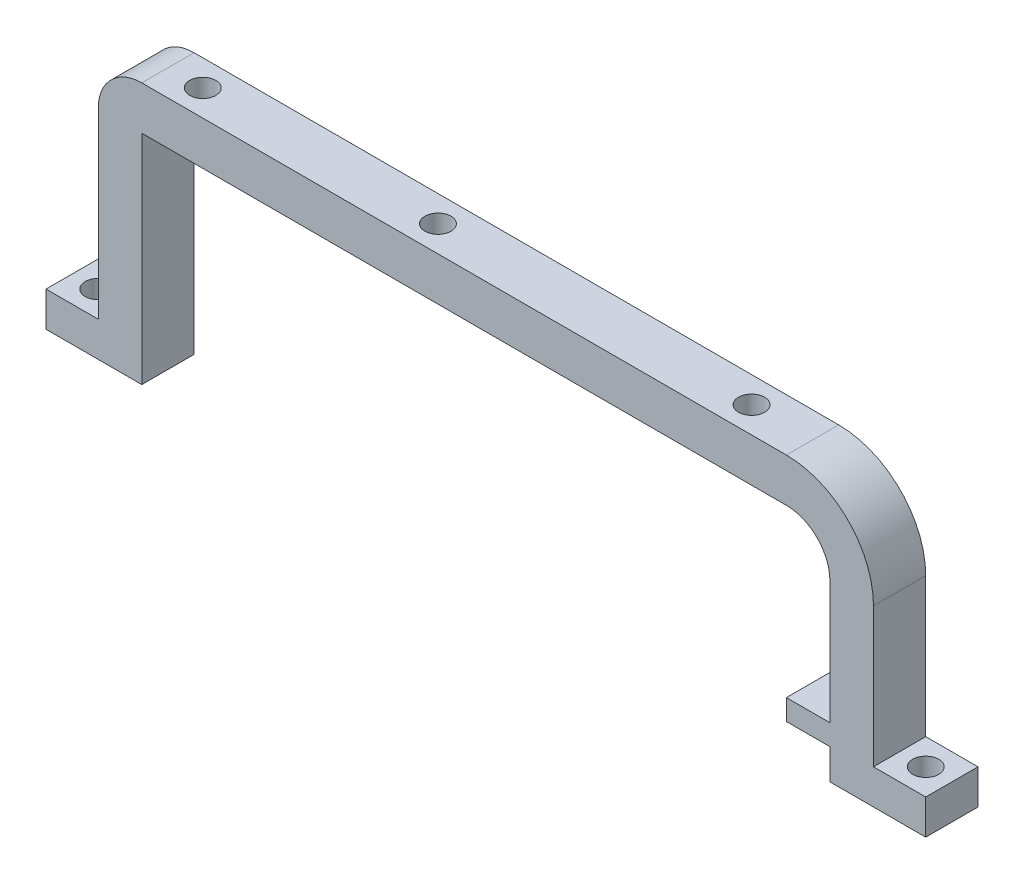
ISO-10303-21;
HEADER;
FILE_DESCRIPTION(('STEP AP214'),'2;1');
FILE_NAME('part.step','',(''),(''),'','','');
FILE_SCHEMA(('AUTOMOTIVE_DESIGN { 1 0 10303 214 1 1 1 1 }'));
ENDSEC;
DATA;
#1=APPLICATION_CONTEXT('core data for automotive mechanical design processes');
#2=APPLICATION_PROTOCOL_DEFINITION('international standard','automotive_design',2000,#1);
#3=PRODUCT_CONTEXT('',#1,'mechanical');
#4=PRODUCT('Part','Part','',(#3));
#5=PRODUCT_RELATED_PRODUCT_CATEGORY('part','',(#4));
#6=PRODUCT_DEFINITION_FORMATION('','',#4);
#7=PRODUCT_DEFINITION_CONTEXT('part definition',#1,'design');
#8=PRODUCT_DEFINITION('design','',#6,#7);
#9=PRODUCT_DEFINITION_SHAPE('','',#8);
#10=(LENGTH_UNIT() NAMED_UNIT(*) SI_UNIT(.MILLI.,.METRE.));
#11=(NAMED_UNIT(*) PLANE_ANGLE_UNIT() SI_UNIT($,.RADIAN.));
#12=(NAMED_UNIT(*) SI_UNIT($,.STERADIAN.) SOLID_ANGLE_UNIT());
#13=UNCERTAINTY_MEASURE_WITH_UNIT(LENGTH_MEASURE(1.E-05),#10,'distance_accuracy_value','');
#14=(GEOMETRIC_REPRESENTATION_CONTEXT(3) GLOBAL_UNCERTAINTY_ASSIGNED_CONTEXT((#13)) GLOBAL_UNIT_ASSIGNED_CONTEXT((#10,
#11,#12)) REPRESENTATION_CONTEXT('',''));
#15=CARTESIAN_POINT('',(0.,0.,0.));
#16=DIRECTION('',(0.,0.,1.));
#17=DIRECTION('',(1.,0.,0.));
#18=AXIS2_PLACEMENT_3D('',#15,#16,#17);
#19=CARTESIAN_POINT('',(-43.196397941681,-5.88336192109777,6.));
#20=DIRECTION('',(0.,1.,0.));
#21=DIRECTION('',(0.,0.,1.));
#22=AXIS2_PLACEMENT_3D('',#19,#20,#21);
#23=PLANE('',#22);
#24=CARTESIAN_POINT('',(-46.196397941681,-5.88336192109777,3.));
#25=DIRECTION('',(0.,1.,0.));
#26=DIRECTION('',(0.,0.,1.));
#27=AXIS2_PLACEMENT_3D('',#24,#25,#26);
#28=CIRCLE('',#27,1.5);
#29=CARTESIAN_POINT('',(-46.196397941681,-5.88336192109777,4.5));
#30=VERTEX_POINT('',#29);
#31=EDGE_CURVE('E451',#30,#30,#28,.T.);
#32=ORIENTED_EDGE('',*,*,#31,.T.);
#33=EDGE_LOOP('',(#32));
#34=FACE_BOUND('',#33,.T.);
#35=DIRECTION('',(1.,0.,0.));
#36=VECTOR('',#35,1.);
#37=CARTESIAN_POINT('',(-43.196397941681,-5.88336192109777,0.));
#38=LINE('',#37,#36);
#39=CARTESIAN_POINT('',(-49.1963979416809,-5.88336192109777,0.));
#40=VERTEX_POINT('',#39);
#41=CARTESIAN_POINT('',(-38.196397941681,-5.88336192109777,0.));
#42=VERTEX_POINT('',#41);
#43=EDGE_CURVE('E117',#40,#42,#38,.T.);
#44=ORIENTED_EDGE('',*,*,#43,.T.);
#45=DIRECTION('',(0.,0.,-1.));
#46=VECTOR('',#45,1.);
#47=CARTESIAN_POINT('',(-38.196397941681,-5.88336192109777,6.));
#48=LINE('',#47,#46);
#49=CARTESIAN_POINT('',(-38.196397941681,-5.88336192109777,6.));
#50=VERTEX_POINT('',#49);
#51=EDGE_CURVE('E11',#50,#42,#48,.T.);
#52=ORIENTED_EDGE('',*,*,#51,.F.);
#53=DIRECTION('',(1.,0.,0.));
#54=VECTOR('',#53,1.);
#55=CARTESIAN_POINT('',(-43.196397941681,-5.88336192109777,6.));
#56=LINE('',#55,#54);
#57=CARTESIAN_POINT('',(-49.1963979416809,-5.88336192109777,6.));
#58=VERTEX_POINT('',#57);
#59=EDGE_CURVE('E123',#58,#50,#56,.T.);
#60=ORIENTED_EDGE('',*,*,#59,.F.);
#61=DIRECTION('',(0.,0.,-1.));
#62=VECTOR('',#61,1.);
#63=CARTESIAN_POINT('',(-49.1963979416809,-5.88336192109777,6.));
#64=LINE('',#63,#62);
#65=EDGE_CURVE('E190',#58,#40,#64,.T.);
#66=ORIENTED_EDGE('',*,*,#65,.T.);
#67=EDGE_LOOP('',(#44,#52,#60,#66));
#68=FACE_BOUND('',#67,.T.);
#69=ADVANCED_FACE('F32',(#34,#68),#23,.F.);
#70=CARTESIAN_POINT('',(-38.196397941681,-5.88336192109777,6.));
#71=DIRECTION('',(-1.,0.,0.));
#72=DIRECTION('',(0.,0.,1.));
#73=AXIS2_PLACEMENT_3D('',#70,#71,#72);
#74=PLANE('',#73);
#75=DIRECTION('',(0.,1.,0.));
#76=VECTOR('',#75,1.);
#77=CARTESIAN_POINT('',(-38.196397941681,-5.88336192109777,0.));
#78=LINE('',#77,#76);
#79=CARTESIAN_POINT('',(-38.196397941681,19.1166380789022,0.));
#80=VERTEX_POINT('',#79);
#81=EDGE_CURVE('E195',#42,#80,#78,.T.);
#82=ORIENTED_EDGE('',*,*,#81,.T.);
#83=DIRECTION('',(0.,0.,-1.));
#84=VECTOR('',#83,1.);
#85=CARTESIAN_POINT('',(-38.196397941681,19.1166380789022,6.));
#86=LINE('',#85,#84);
#87=CARTESIAN_POINT('',(-38.196397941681,19.1166380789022,6.));
#88=VERTEX_POINT('',#87);
#89=EDGE_CURVE('E40',#88,#80,#86,.T.);
#90=ORIENTED_EDGE('',*,*,#89,.F.);
#91=DIRECTION('',(0.,1.,0.));
#92=VECTOR('',#91,1.);
#93=CARTESIAN_POINT('',(-38.196397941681,-5.88336192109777,6.));
#94=LINE('',#93,#92);
#95=EDGE_CURVE('E334',#50,#88,#94,.T.);
#96=ORIENTED_EDGE('',*,*,#95,.F.);
#97=ORIENTED_EDGE('',*,*,#51,.T.);
#98=EDGE_LOOP('',(#82,#90,#96,#97));
#99=FACE_BOUND('',#98,.T.);
#100=ADVANCED_FACE('F339',(#99),#74,.F.);
#101=CARTESIAN_POINT('',(-38.196397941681,19.1166380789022,6.));
#102=DIRECTION('',(0.,1.,0.));
#103=DIRECTION('',(0.,0.,1.));
#104=AXIS2_PLACEMENT_3D('',#101,#102,#103);
#105=PLANE('',#104);
#106=CARTESIAN_POINT('',(-7.19639794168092,19.1166380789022,3.));
#107=DIRECTION('',(0.,1.,0.));
#108=DIRECTION('',(0.,0.,1.));
#109=AXIS2_PLACEMENT_3D('',#106,#107,#108);
#110=CIRCLE('',#109,1.5);
#111=CARTESIAN_POINT('',(-7.19639794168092,19.1166380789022,4.5));
#112=VERTEX_POINT('',#111);
#113=EDGE_CURVE('E432',#112,#112,#110,.T.);
#114=ORIENTED_EDGE('',*,*,#113,.T.);
#115=EDGE_LOOP('',(#114));
#116=FACE_BOUND('',#115,.T.);
#117=CARTESIAN_POINT('',(-34.1963979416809,19.1166380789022,3.));
#118=DIRECTION('',(0.,1.,0.));
#119=DIRECTION('',(0.,0.,1.));
#120=AXIS2_PLACEMENT_3D('',#117,#118,#119);
#121=CIRCLE('',#120,1.5);
#122=CARTESIAN_POINT('',(-34.1963979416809,19.1166380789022,4.5));
#123=VERTEX_POINT('',#122);
#124=EDGE_CURVE('E436',#123,#123,#121,.T.);
#125=ORIENTED_EDGE('',*,*,#124,.T.);
#126=EDGE_LOOP('',(#125));
#127=FACE_BOUND('',#126,.T.);
#128=CARTESIAN_POINT('',(28.8036020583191,19.1166380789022,3.));
#129=DIRECTION('',(0.,1.,0.));
#130=DIRECTION('',(0.,0.,1.));
#131=AXIS2_PLACEMENT_3D('',#128,#129,#130);
#132=CIRCLE('',#131,1.5);
#133=CARTESIAN_POINT('',(28.8036020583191,19.1166380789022,4.5));
#134=VERTEX_POINT('',#133);
#135=EDGE_CURVE('E445',#134,#134,#132,.T.);
#136=ORIENTED_EDGE('',*,*,#135,.T.);
#137=EDGE_LOOP('',(#136));
#138=FACE_BOUND('',#137,.T.);
#139=DIRECTION('',(1.,0.,0.));
#140=VECTOR('',#139,1.);
#141=CARTESIAN_POINT('',(-38.196397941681,19.1166380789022,0.));
#142=LINE('',#141,#140);
#143=CARTESIAN_POINT('',(35.803602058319,19.1166380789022,0.));
#144=VERTEX_POINT('',#143);
#145=EDGE_CURVE('E198',#80,#144,#142,.T.);
#146=ORIENTED_EDGE('',*,*,#145,.T.);
#147=DIRECTION('',(0.,0.,-1.));
#148=VECTOR('',#147,1.);
#149=CARTESIAN_POINT('',(35.803602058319,19.1166380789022,6.));
#150=LINE('',#149,#148);
#151=CARTESIAN_POINT('',(35.803602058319,19.1166380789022,6.));
#152=VERTEX_POINT('',#151);
#153=EDGE_CURVE('E271',#152,#144,#150,.T.);
#154=ORIENTED_EDGE('',*,*,#153,.F.);
#155=DIRECTION('',(1.,0.,0.));
#156=VECTOR('',#155,1.);
#157=CARTESIAN_POINT('',(-38.196397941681,19.1166380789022,6.));
#158=LINE('',#157,#156);
#159=EDGE_CURVE('E280',#88,#152,#158,.T.);
#160=ORIENTED_EDGE('',*,*,#159,.F.);
#161=ORIENTED_EDGE('',*,*,#89,.T.);
#162=EDGE_LOOP('',(#146,#154,#160,#161));
#163=FACE_BOUND('',#162,.T.);
#164=ADVANCED_FACE('F278',(#116,#127,#138,#163),#105,.F.);
#165=CARTESIAN_POINT('',(35.8036020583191,14.1166380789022,6.));
#166=DIRECTION('',(0.,0.,-1.));
#167=DIRECTION('',(-1.,0.,0.));
#168=AXIS2_PLACEMENT_3D('',#165,#166,#167);
#169=CYLINDRICAL_SURFACE('',#168,5.);
#170=CARTESIAN_POINT('',(35.8036020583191,14.1166380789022,0.));
#171=DIRECTION('',(0.,0.,-1.));
#172=DIRECTION('',(-1.,0.,0.));
#173=AXIS2_PLACEMENT_3D('',#170,#171,#172);
#174=CIRCLE('',#173,5.);
#175=CARTESIAN_POINT('',(40.8036020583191,14.1166380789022,0.));
#176=VERTEX_POINT('',#175);
#177=EDGE_CURVE('E200',#144,#176,#174,.T.);
#178=ORIENTED_EDGE('',*,*,#177,.T.);
#179=DIRECTION('',(0.,0.,-1.));
#180=VECTOR('',#179,1.);
#181=CARTESIAN_POINT('',(40.8036020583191,14.1166380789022,6.));
#182=LINE('',#181,#180);
#183=CARTESIAN_POINT('',(40.8036020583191,14.1166380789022,6.));
#184=VERTEX_POINT('',#183);
#185=EDGE_CURVE('E268',#184,#176,#182,.T.);
#186=ORIENTED_EDGE('',*,*,#185,.F.);
#187=CARTESIAN_POINT('',(35.8036020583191,14.1166380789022,6.));
#188=DIRECTION('',(0.,0.,-1.));
#189=DIRECTION('',(-1.,0.,0.));
#190=AXIS2_PLACEMENT_3D('',#187,#188,#189);
#191=CIRCLE('',#190,5.);
#192=EDGE_CURVE('E298',#152,#184,#191,.T.);
#193=ORIENTED_EDGE('',*,*,#192,.F.);
#194=ORIENTED_EDGE('',*,*,#153,.T.);
#195=EDGE_LOOP('',(#178,#186,#193,#194));
#196=FACE_BOUND('',#195,.T.);
#197=ADVANCED_FACE('F289',(#196),#169,.F.);
#198=CARTESIAN_POINT('',(40.8036020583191,0.,6.));
#199=DIRECTION('',(1.,0.,0.));
#200=DIRECTION('',(0.,0.,-1.));
#201=AXIS2_PLACEMENT_3D('',#198,#199,#200);
#202=PLANE('',#201);
#203=DIRECTION('',(0.,-1.,0.));
#204=VECTOR('',#203,1.);
#205=CARTESIAN_POINT('',(40.8036020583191,0.,0.));
#206=LINE('',#205,#204);
#207=CARTESIAN_POINT('',(40.8036020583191,0.,0.));
#208=VERTEX_POINT('',#207);
#209=EDGE_CURVE('E202',#176,#208,#206,.T.);
#210=ORIENTED_EDGE('',*,*,#209,.T.);
#211=DIRECTION('',(0.,0.,-1.));
#212=VECTOR('',#211,1.);
#213=CARTESIAN_POINT('',(40.8036020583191,0.,6.));
#214=LINE('',#213,#212);
#215=CARTESIAN_POINT('',(40.8036020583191,0.,6.));
#216=VERTEX_POINT('',#215);
#217=EDGE_CURVE('E265',#216,#208,#214,.T.);
#218=ORIENTED_EDGE('',*,*,#217,.F.);
#219=DIRECTION('',(0.,-1.,0.));
#220=VECTOR('',#219,1.);
#221=CARTESIAN_POINT('',(40.8036020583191,0.,6.));
#222=LINE('',#221,#220);
#223=EDGE_CURVE('E295',#184,#216,#222,.T.);
#224=ORIENTED_EDGE('',*,*,#223,.F.);
#225=ORIENTED_EDGE('',*,*,#185,.T.);
#226=EDGE_LOOP('',(#210,#218,#224,#225));
#227=FACE_BOUND('',#226,.T.);
#228=ADVANCED_FACE('F293',(#227),#202,.F.);
#229=CARTESIAN_POINT('',(35.8036020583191,0.,6.));
#230=DIRECTION('',(0.,-1.,0.));
#231=DIRECTION('',(0.,0.,-1.));
#232=AXIS2_PLACEMENT_3D('',#229,#230,#231);
#233=PLANE('',#232);
#234=DIRECTION('',(-1.,0.,0.));
#235=VECTOR('',#234,1.);
#236=CARTESIAN_POINT('',(35.8036020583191,0.,0.));
#237=LINE('',#236,#235);
#238=CARTESIAN_POINT('',(35.8036020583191,0.,0.));
#239=VERTEX_POINT('',#238);
#240=EDGE_CURVE('E204',#208,#239,#237,.T.);
#241=ORIENTED_EDGE('',*,*,#240,.T.);
#242=DIRECTION('',(0.,0.,-1.));
#243=VECTOR('',#242,1.);
#244=CARTESIAN_POINT('',(35.8036020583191,0.,6.));
#245=LINE('',#244,#243);
#246=CARTESIAN_POINT('',(35.8036020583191,0.,6.));
#247=VERTEX_POINT('',#246);
#248=EDGE_CURVE('E262',#247,#239,#245,.T.);
#249=ORIENTED_EDGE('',*,*,#248,.F.);
#250=DIRECTION('',(-1.,0.,0.));
#251=VECTOR('',#250,1.);
#252=CARTESIAN_POINT('',(35.8036020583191,0.,6.));
#253=LINE('',#252,#251);
#254=EDGE_CURVE('E297',#216,#247,#253,.T.);
#255=ORIENTED_EDGE('',*,*,#254,.F.);
#256=ORIENTED_EDGE('',*,*,#217,.T.);
#257=EDGE_LOOP('',(#241,#249,#255,#256));
#258=FACE_BOUND('',#257,.T.);
#259=ADVANCED_FACE('F353',(#258),#233,.F.);
#260=CARTESIAN_POINT('',(35.8036020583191,-2.38336192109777,6.));
#261=DIRECTION('',(1.,0.,0.));
#262=DIRECTION('',(0.,0.,-1.));
#263=AXIS2_PLACEMENT_3D('',#260,#261,#262);
#264=PLANE('',#263);
#265=DIRECTION('',(0.,-1.,0.));
#266=VECTOR('',#265,1.);
#267=CARTESIAN_POINT('',(35.8036020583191,-2.38336192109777,0.));
#268=LINE('',#267,#266);
#269=CARTESIAN_POINT('',(35.8036020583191,-2.38336192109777,0.));
#270=VERTEX_POINT('',#269);
#271=EDGE_CURVE('E206',#239,#270,#268,.T.);
#272=ORIENTED_EDGE('',*,*,#271,.T.);
#273=DIRECTION('',(0.,0.,-1.));
#274=VECTOR('',#273,1.);
#275=CARTESIAN_POINT('',(35.8036020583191,-2.38336192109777,6.));
#276=LINE('',#275,#274);
#277=CARTESIAN_POINT('',(35.8036020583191,-2.38336192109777,6.));
#278=VERTEX_POINT('',#277);
#279=EDGE_CURVE('E259',#278,#270,#276,.T.);
#280=ORIENTED_EDGE('',*,*,#279,.F.);
#281=DIRECTION('',(0.,-1.,0.));
#282=VECTOR('',#281,1.);
#283=CARTESIAN_POINT('',(35.8036020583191,-2.38336192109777,6.));
#284=LINE('',#283,#282);
#285=EDGE_CURVE('E300',#247,#278,#284,.T.);
#286=ORIENTED_EDGE('',*,*,#285,.F.);
#287=ORIENTED_EDGE('',*,*,#248,.T.);
#288=EDGE_LOOP('',(#272,#280,#286,#287));
#289=FACE_BOUND('',#288,.T.);
#290=ADVANCED_FACE('F356',(#289),#264,.F.);
#291=CARTESIAN_POINT('',(35.8036020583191,-2.38336192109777,6.));
#292=DIRECTION('',(0.,1.,0.));
#293=DIRECTION('',(0.,0.,1.));
#294=AXIS2_PLACEMENT_3D('',#291,#292,#293);
#295=PLANE('',#294);
#296=DIRECTION('',(1.,0.,0.));
#297=VECTOR('',#296,1.);
#298=CARTESIAN_POINT('',(35.8036020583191,-2.38336192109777,0.));
#299=LINE('',#298,#297);
#300=CARTESIAN_POINT('',(40.8036020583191,-2.38336192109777,0.));
#301=VERTEX_POINT('',#300);
#302=EDGE_CURVE('E208',#270,#301,#299,.T.);
#303=ORIENTED_EDGE('',*,*,#302,.T.);
#304=DIRECTION('',(0.,0.,-1.));
#305=VECTOR('',#304,1.);
#306=CARTESIAN_POINT('',(40.8036020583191,-2.38336192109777,6.));
#307=LINE('',#306,#305);
#308=CARTESIAN_POINT('',(40.8036020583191,-2.38336192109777,6.));
#309=VERTEX_POINT('',#308);
#310=EDGE_CURVE('E256',#309,#301,#307,.T.);
#311=ORIENTED_EDGE('',*,*,#310,.F.);
#312=DIRECTION('',(1.,0.,0.));
#313=VECTOR('',#312,1.);
#314=CARTESIAN_POINT('',(35.8036020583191,-2.38336192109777,6.));
#315=LINE('',#314,#313);
#316=EDGE_CURVE('E306',#278,#309,#315,.T.);
#317=ORIENTED_EDGE('',*,*,#316,.F.);
#318=ORIENTED_EDGE('',*,*,#279,.T.);
#319=EDGE_LOOP('',(#303,#311,#317,#318));
#320=FACE_BOUND('',#319,.T.);
#321=ADVANCED_FACE('F360',(#320),#295,.F.);
#322=CARTESIAN_POINT('',(40.8036020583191,-5.88336192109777,6.));
#323=DIRECTION('',(1.,0.,0.));
#324=DIRECTION('',(0.,0.,-1.));
#325=AXIS2_PLACEMENT_3D('',#322,#323,#324);
#326=PLANE('',#325);
#327=DIRECTION('',(0.,-1.,0.));
#328=VECTOR('',#327,1.);
#329=CARTESIAN_POINT('',(40.8036020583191,-5.88336192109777,0.));
#330=LINE('',#329,#328);
#331=CARTESIAN_POINT('',(40.8036020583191,-5.88336192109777,0.));
#332=VERTEX_POINT('',#331);
#333=EDGE_CURVE('E210',#301,#332,#330,.T.);
#334=ORIENTED_EDGE('',*,*,#333,.T.);
#335=DIRECTION('',(0.,0.,-1.));
#336=VECTOR('',#335,1.);
#337=CARTESIAN_POINT('',(40.8036020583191,-5.88336192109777,6.));
#338=LINE('',#337,#336);
#339=CARTESIAN_POINT('',(40.8036020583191,-5.88336192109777,6.));
#340=VERTEX_POINT('',#339);
#341=EDGE_CURVE('E253',#340,#332,#338,.T.);
#342=ORIENTED_EDGE('',*,*,#341,.F.);
#343=DIRECTION('',(0.,-1.,0.));
#344=VECTOR('',#343,1.);
#345=CARTESIAN_POINT('',(40.8036020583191,-5.88336192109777,6.));
#346=LINE('',#345,#344);
#347=EDGE_CURVE('E308',#309,#340,#346,.T.);
#348=ORIENTED_EDGE('',*,*,#347,.F.);
#349=ORIENTED_EDGE('',*,*,#310,.T.);
#350=EDGE_LOOP('',(#334,#342,#348,#349));
#351=FACE_BOUND('',#350,.T.);
#352=ADVANCED_FACE('F364',(#351),#326,.F.);
#353=CARTESIAN_POINT('',(51.8036020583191,-5.88336192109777,6.));
#354=DIRECTION('',(0.,1.,0.));
#355=DIRECTION('',(0.,0.,1.));
#356=AXIS2_PLACEMENT_3D('',#353,#354,#355);
#357=PLANE('',#356);
#358=CARTESIAN_POINT('',(48.8036020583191,-5.88336192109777,3.));
#359=DIRECTION('',(0.,1.,0.));
#360=DIRECTION('',(0.,0.,1.));
#361=AXIS2_PLACEMENT_3D('',#358,#359,#360);
#362=CIRCLE('',#361,1.5);
#363=CARTESIAN_POINT('',(48.8036020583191,-5.88336192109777,4.5));
#364=VERTEX_POINT('',#363);
#365=EDGE_CURVE('E196',#364,#364,#362,.T.);
#366=ORIENTED_EDGE('',*,*,#365,.T.);
#367=EDGE_LOOP('',(#366));
#368=FACE_BOUND('',#367,.T.);
#369=DIRECTION('',(1.,0.,0.));
#370=VECTOR('',#369,1.);
#371=CARTESIAN_POINT('',(51.8036020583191,-5.88336192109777,0.));
#372=LINE('',#371,#370);
#373=CARTESIAN_POINT('',(51.8036020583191,-5.88336192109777,0.));
#374=VERTEX_POINT('',#373);
#375=EDGE_CURVE('E213',#332,#374,#372,.T.);
#376=ORIENTED_EDGE('',*,*,#375,.T.);
#377=DIRECTION('',(0.,0.,-1.));
#378=VECTOR('',#377,1.);
#379=CARTESIAN_POINT('',(51.8036020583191,-5.88336192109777,6.));
#380=LINE('',#379,#378);
#381=CARTESIAN_POINT('',(51.8036020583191,-5.88336192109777,6.));
#382=VERTEX_POINT('',#381);
#383=EDGE_CURVE('E250',#382,#374,#380,.T.);
#384=ORIENTED_EDGE('',*,*,#383,.F.);
#385=DIRECTION('',(1.,0.,0.));
#386=VECTOR('',#385,1.);
#387=CARTESIAN_POINT('',(40.8036020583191,-5.88336192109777,6.));
#388=LINE('',#387,#386);
#389=EDGE_CURVE('E310',#340,#382,#388,.T.);
#390=ORIENTED_EDGE('',*,*,#389,.F.);
#391=ORIENTED_EDGE('',*,*,#341,.T.);
#392=EDGE_LOOP('',(#376,#384,#390,#391));
#393=FACE_BOUND('',#392,.T.);
#394=ADVANCED_FACE('F368',(#368,#393),#357,.F.);
#395=CARTESIAN_POINT('',(51.8036020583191,-5.88336192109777,6.));
#396=DIRECTION('',(-1.,0.,0.));
#397=DIRECTION('',(0.,0.,1.));
#398=AXIS2_PLACEMENT_3D('',#395,#396,#397);
#399=PLANE('',#398);
#400=DIRECTION('',(0.,1.,0.));
#401=VECTOR('',#400,1.);
#402=CARTESIAN_POINT('',(51.8036020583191,-5.88336192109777,0.));
#403=LINE('',#402,#401);
#404=CARTESIAN_POINT('',(51.8036020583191,-1.88336192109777,0.));
#405=VERTEX_POINT('',#404);
#406=EDGE_CURVE('E215',#374,#405,#403,.T.);
#407=ORIENTED_EDGE('',*,*,#406,.T.);
#408=DIRECTION('',(0.,0.,-1.));
#409=VECTOR('',#408,1.);
#410=CARTESIAN_POINT('',(51.8036020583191,-1.88336192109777,6.));
#411=LINE('',#410,#409);
#412=CARTESIAN_POINT('',(51.8036020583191,-1.88336192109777,6.));
#413=VERTEX_POINT('',#412);
#414=EDGE_CURVE('E247',#413,#405,#411,.T.);
#415=ORIENTED_EDGE('',*,*,#414,.F.);
#416=DIRECTION('',(0.,1.,0.));
#417=VECTOR('',#416,1.);
#418=CARTESIAN_POINT('',(51.8036020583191,-5.88336192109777,6.));
#419=LINE('',#418,#417);
#420=EDGE_CURVE('E312',#382,#413,#419,.T.);
#421=ORIENTED_EDGE('',*,*,#420,.F.);
#422=ORIENTED_EDGE('',*,*,#383,.T.);
#423=EDGE_LOOP('',(#407,#415,#421,#422));
#424=FACE_BOUND('',#423,.T.);
#425=ADVANCED_FACE('F372',(#424),#399,.F.);
#426=CARTESIAN_POINT('',(51.8036020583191,-1.88336192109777,6.));
#427=DIRECTION('',(0.,-1.,0.));
#428=DIRECTION('',(0.,0.,-1.));
#429=AXIS2_PLACEMENT_3D('',#426,#427,#428);
#430=PLANE('',#429);
#431=CARTESIAN_POINT('',(48.8036020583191,-1.88336192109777,3.));
#432=DIRECTION('',(0.,1.,0.));
#433=DIRECTION('',(0.,0.,1.));
#434=AXIS2_PLACEMENT_3D('',#431,#432,#433);
#435=CIRCLE('',#434,1.5);
#436=CARTESIAN_POINT('',(48.8036020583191,-1.88336192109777,4.5));
#437=VERTEX_POINT('',#436);
#438=EDGE_CURVE('E453',#437,#437,#435,.T.);
#439=ORIENTED_EDGE('',*,*,#438,.F.);
#440=EDGE_LOOP('',(#439));
#441=FACE_BOUND('',#440,.T.);
#442=DIRECTION('',(-1.,0.,0.));
#443=VECTOR('',#442,1.);
#444=CARTESIAN_POINT('',(51.8036020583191,-1.88336192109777,0.));
#445=LINE('',#444,#443);
#446=CARTESIAN_POINT('',(45.8036020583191,-1.88336192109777,0.));
#447=VERTEX_POINT('',#446);
#448=EDGE_CURVE('E217',#405,#447,#445,.T.);
#449=ORIENTED_EDGE('',*,*,#448,.T.);
#450=DIRECTION('',(0.,0.,-1.));
#451=VECTOR('',#450,1.);
#452=CARTESIAN_POINT('',(45.8036020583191,-1.88336192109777,6.));
#453=LINE('',#452,#451);
#454=CARTESIAN_POINT('',(45.8036020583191,-1.88336192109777,6.));
#455=VERTEX_POINT('',#454);
#456=EDGE_CURVE('E244',#455,#447,#453,.T.);
#457=ORIENTED_EDGE('',*,*,#456,.F.);
#458=DIRECTION('',(-1.,0.,0.));
#459=VECTOR('',#458,1.);
#460=CARTESIAN_POINT('',(51.8036020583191,-1.88336192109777,6.));
#461=LINE('',#460,#459);
#462=EDGE_CURVE('E314',#413,#455,#461,.T.);
#463=ORIENTED_EDGE('',*,*,#462,.F.);
#464=ORIENTED_EDGE('',*,*,#414,.T.);
#465=EDGE_LOOP('',(#449,#457,#463,#464));
#466=FACE_BOUND('',#465,.T.);
#467=ADVANCED_FACE('F376',(#441,#466),#430,.F.);
#468=CARTESIAN_POINT('',(45.8036020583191,-1.88336192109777,6.));
#469=DIRECTION('',(-1.,0.,0.));
#470=DIRECTION('',(0.,-1.,0.));
#471=AXIS2_PLACEMENT_3D('',#468,#469,#470);
#472=PLANE('',#471);
#473=DIRECTION('',(0.,1.,0.));
#474=VECTOR('',#473,1.);
#475=CARTESIAN_POINT('',(45.8036020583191,-1.88336192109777,0.));
#476=LINE('',#475,#474);
#477=CARTESIAN_POINT('',(45.8036020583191,14.1166380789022,0.));
#478=VERTEX_POINT('',#477);
#479=EDGE_CURVE('E219',#447,#478,#476,.T.);
#480=ORIENTED_EDGE('',*,*,#479,.T.);
#481=DIRECTION('',(0.,0.,-1.));
#482=VECTOR('',#481,1.);
#483=CARTESIAN_POINT('',(45.8036020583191,14.1166380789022,6.));
#484=LINE('',#483,#482);
#485=CARTESIAN_POINT('',(45.8036020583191,14.1166380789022,6.));
#486=VERTEX_POINT('',#485);
#487=EDGE_CURVE('E241',#486,#478,#484,.T.);
#488=ORIENTED_EDGE('',*,*,#487,.F.);
#489=DIRECTION('',(0.,1.,0.));
#490=VECTOR('',#489,1.);
#491=CARTESIAN_POINT('',(45.8036020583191,-1.88336192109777,6.));
#492=LINE('',#491,#490);
#493=EDGE_CURVE('E316',#455,#486,#492,.T.);
#494=ORIENTED_EDGE('',*,*,#493,.F.);
#495=ORIENTED_EDGE('',*,*,#456,.T.);
#496=EDGE_LOOP('',(#480,#488,#494,#495));
#497=FACE_BOUND('',#496,.T.);
#498=ADVANCED_FACE('F380',(#497),#472,.F.);
#499=CARTESIAN_POINT('',(35.8036020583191,14.1166380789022,6.));
#500=DIRECTION('',(0.,0.,-1.));
#501=DIRECTION('',(-1.,0.,0.));
#502=AXIS2_PLACEMENT_3D('',#499,#500,#501);
#503=CYLINDRICAL_SURFACE('',#502,10.);
#504=CARTESIAN_POINT('',(35.8036020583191,14.1166380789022,0.));
#505=DIRECTION('',(0.,0.,1.));
#506=DIRECTION('',(-1.,0.,0.));
#507=AXIS2_PLACEMENT_3D('',#504,#505,#506);
#508=CIRCLE('',#507,10.);
#509=CARTESIAN_POINT('',(35.803602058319,24.1166380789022,0.));
#510=VERTEX_POINT('',#509);
#511=EDGE_CURVE('E221',#478,#510,#508,.T.);
#512=ORIENTED_EDGE('',*,*,#511,.T.);
#513=DIRECTION('',(0.,0.,-1.));
#514=VECTOR('',#513,1.);
#515=CARTESIAN_POINT('',(35.803602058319,24.1166380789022,6.));
#516=LINE('',#515,#514);
#517=CARTESIAN_POINT('',(35.803602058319,24.1166380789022,6.));
#518=VERTEX_POINT('',#517);
#519=EDGE_CURVE('E238',#518,#510,#516,.T.);
#520=ORIENTED_EDGE('',*,*,#519,.F.);
#521=CARTESIAN_POINT('',(35.8036020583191,14.1166380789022,6.));
#522=DIRECTION('',(0.,0.,1.));
#523=DIRECTION('',(-1.,0.,0.));
#524=AXIS2_PLACEMENT_3D('',#521,#522,#523);
#525=CIRCLE('',#524,10.);
#526=EDGE_CURVE('E318',#486,#518,#525,.T.);
#527=ORIENTED_EDGE('',*,*,#526,.F.);
#528=ORIENTED_EDGE('',*,*,#487,.T.);
#529=EDGE_LOOP('',(#512,#520,#527,#528));
#530=FACE_BOUND('',#529,.T.);
#531=ADVANCED_FACE('F384',(#530),#503,.T.);
#532=CARTESIAN_POINT('',(-38.1963979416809,24.1166380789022,6.));
#533=DIRECTION('',(0.,-1.,0.));
#534=DIRECTION('',(0.,0.,-1.));
#535=AXIS2_PLACEMENT_3D('',#532,#533,#534);
#536=PLANE('',#535);
#537=CARTESIAN_POINT('',(-7.19639794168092,24.1166380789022,3.));
#538=DIRECTION('',(0.,1.,0.));
#539=DIRECTION('',(0.,0.,1.));
#540=AXIS2_PLACEMENT_3D('',#537,#538,#539);
#541=CIRCLE('',#540,1.5);
#542=CARTESIAN_POINT('',(-7.19639794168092,24.1166380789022,4.5));
#543=VERTEX_POINT('',#542);
#544=EDGE_CURVE('E429',#543,#543,#541,.T.);
#545=ORIENTED_EDGE('',*,*,#544,.F.);
#546=EDGE_LOOP('',(#545));
#547=FACE_BOUND('',#546,.T.);
#548=CARTESIAN_POINT('',(-34.1963979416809,24.1166380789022,3.));
#549=DIRECTION('',(0.,1.,0.));
#550=DIRECTION('',(0.,0.,1.));
#551=AXIS2_PLACEMENT_3D('',#548,#549,#550);
#552=CIRCLE('',#551,1.5);
#553=CARTESIAN_POINT('',(-34.1963979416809,24.1166380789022,4.5));
#554=VERTEX_POINT('',#553);
#555=EDGE_CURVE('E433',#554,#554,#552,.T.);
#556=ORIENTED_EDGE('',*,*,#555,.F.);
#557=EDGE_LOOP('',(#556));
#558=FACE_BOUND('',#557,.T.);
#559=CARTESIAN_POINT('',(28.8036020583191,24.1166380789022,3.));
#560=DIRECTION('',(0.,1.,0.));
#561=DIRECTION('',(0.,0.,1.));
#562=AXIS2_PLACEMENT_3D('',#559,#560,#561);
#563=CIRCLE('',#562,1.5);
#564=CARTESIAN_POINT('',(28.8036020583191,24.1166380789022,4.5));
#565=VERTEX_POINT('',#564);
#566=EDGE_CURVE('E442',#565,#565,#563,.T.);
#567=ORIENTED_EDGE('',*,*,#566,.F.);
#568=EDGE_LOOP('',(#567));
#569=FACE_BOUND('',#568,.T.);
#570=DIRECTION('',(-1.,0.,0.));
#571=VECTOR('',#570,1.);
#572=CARTESIAN_POINT('',(-38.1963979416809,24.1166380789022,0.));
#573=LINE('',#572,#571);
#574=CARTESIAN_POINT('',(-38.1963979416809,24.1166380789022,0.));
#575=VERTEX_POINT('',#574);
#576=EDGE_CURVE('E223',#510,#575,#573,.T.);
#577=ORIENTED_EDGE('',*,*,#576,.T.);
#578=DIRECTION('',(0.,0.,-1.));
#579=VECTOR('',#578,1.);
#580=CARTESIAN_POINT('',(-38.1963979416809,24.1166380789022,6.));
#581=LINE('',#580,#579);
#582=CARTESIAN_POINT('',(-38.1963979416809,24.1166380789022,6.));
#583=VERTEX_POINT('',#582);
#584=EDGE_CURVE('E235',#583,#575,#581,.T.);
#585=ORIENTED_EDGE('',*,*,#584,.F.);
#586=DIRECTION('',(-1.,0.,0.));
#587=VECTOR('',#586,1.);
#588=CARTESIAN_POINT('',(-38.1963979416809,24.1166380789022,6.));
#589=LINE('',#588,#587);
#590=EDGE_CURVE('E320',#518,#583,#589,.T.);
#591=ORIENTED_EDGE('',*,*,#590,.F.);
#592=ORIENTED_EDGE('',*,*,#519,.T.);
#593=EDGE_LOOP('',(#577,#585,#591,#592));
#594=FACE_BOUND('',#593,.T.);
#595=ADVANCED_FACE('F326',(#547,#558,#569,#594),#536,.F.);
#596=CARTESIAN_POINT('',(-38.196397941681,19.1166380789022,6.));
#597=DIRECTION('',(0.,0.,-1.));
#598=DIRECTION('',(-1.,0.,0.));
#599=AXIS2_PLACEMENT_3D('',#596,#597,#598);
#600=CYLINDRICAL_SURFACE('',#599,5.);
#601=CARTESIAN_POINT('',(-38.196397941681,19.1166380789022,0.));
#602=DIRECTION('',(0.,0.,1.));
#603=DIRECTION('',(1.,0.,0.));
#604=AXIS2_PLACEMENT_3D('',#601,#602,#603);
#605=CIRCLE('',#604,5.);
#606=CARTESIAN_POINT('',(-43.196397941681,19.1166380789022,0.));
#607=VERTEX_POINT('',#606);
#608=EDGE_CURVE('E225',#575,#607,#605,.T.);
#609=ORIENTED_EDGE('',*,*,#608,.T.);
#610=DIRECTION('',(0.,0.,-1.));
#611=VECTOR('',#610,1.);
#612=CARTESIAN_POINT('',(-43.196397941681,19.1166380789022,6.));
#613=LINE('',#612,#611);
#614=CARTESIAN_POINT('',(-43.196397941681,19.1166380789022,6.));
#615=VERTEX_POINT('',#614);
#616=EDGE_CURVE('E185',#615,#607,#613,.T.);
#617=ORIENTED_EDGE('',*,*,#616,.F.);
#618=CARTESIAN_POINT('',(-38.196397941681,19.1166380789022,6.));
#619=DIRECTION('',(0.,0.,1.));
#620=DIRECTION('',(1.,0.,0.));
#621=AXIS2_PLACEMENT_3D('',#618,#619,#620);
#622=CIRCLE('',#621,5.);
#623=EDGE_CURVE('E176',#583,#615,#622,.T.);
#624=ORIENTED_EDGE('',*,*,#623,.F.);
#625=ORIENTED_EDGE('',*,*,#584,.T.);
#626=EDGE_LOOP('',(#609,#617,#624,#625));
#627=FACE_BOUND('',#626,.T.);
#628=ADVANCED_FACE('F330',(#627),#600,.T.);
#629=CARTESIAN_POINT('',(-43.196397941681,-1.88336192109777,6.));
#630=DIRECTION('',(1.,0.,0.));
#631=DIRECTION('',(0.,0.,-1.));
#632=AXIS2_PLACEMENT_3D('',#629,#630,#631);
#633=PLANE('',#632);
#634=DIRECTION('',(0.,-1.,0.));
#635=VECTOR('',#634,1.);
#636=CARTESIAN_POINT('',(-43.196397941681,-1.88336192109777,0.));
#637=LINE('',#636,#635);
#638=CARTESIAN_POINT('',(-43.196397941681,-1.88336192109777,0.));
#639=VERTEX_POINT('',#638);
#640=EDGE_CURVE('E184',#607,#639,#637,.T.);
#641=ORIENTED_EDGE('',*,*,#640,.T.);
#642=DIRECTION('',(0.,0.,-1.));
#643=VECTOR('',#642,1.);
#644=CARTESIAN_POINT('',(-43.196397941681,-1.88336192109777,6.));
#645=LINE('',#644,#643);
#646=CARTESIAN_POINT('',(-43.196397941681,-1.88336192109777,6.));
#647=VERTEX_POINT('',#646);
#648=EDGE_CURVE('E181',#647,#639,#645,.T.);
#649=ORIENTED_EDGE('',*,*,#648,.F.);
#650=DIRECTION('',(0.,-1.,0.));
#651=VECTOR('',#650,1.);
#652=CARTESIAN_POINT('',(-43.196397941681,-1.88336192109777,6.));
#653=LINE('',#652,#651);
#654=EDGE_CURVE('E170',#615,#647,#653,.T.);
#655=ORIENTED_EDGE('',*,*,#654,.F.);
#656=ORIENTED_EDGE('',*,*,#616,.T.);
#657=EDGE_LOOP('',(#641,#649,#655,#656));
#658=FACE_BOUND('',#657,.T.);
#659=ADVANCED_FACE('F182',(#658),#633,.F.);
#660=CARTESIAN_POINT('',(-43.196397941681,-1.88336192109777,6.));
#661=DIRECTION('',(0.,-1.,0.));
#662=DIRECTION('',(0.,0.,-1.));
#663=AXIS2_PLACEMENT_3D('',#660,#661,#662);
#664=PLANE('',#663);
#665=CARTESIAN_POINT('',(-46.196397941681,-1.88336192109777,3.));
#666=DIRECTION('',(0.,1.,0.));
#667=DIRECTION('',(0.,0.,1.));
#668=AXIS2_PLACEMENT_3D('',#665,#666,#667);
#669=CIRCLE('',#668,1.5);
#670=CARTESIAN_POINT('',(-46.196397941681,-1.88336192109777,4.5));
#671=VERTEX_POINT('',#670);
#672=EDGE_CURVE('E448',#671,#671,#669,.T.);
#673=ORIENTED_EDGE('',*,*,#672,.F.);
#674=EDGE_LOOP('',(#673));
#675=FACE_BOUND('',#674,.T.);
#676=DIRECTION('',(-1.,0.,0.));
#677=VECTOR('',#676,1.);
#678=CARTESIAN_POINT('',(-43.196397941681,-1.88336192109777,0.));
#679=LINE('',#678,#677);
#680=CARTESIAN_POINT('',(-49.1963979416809,-1.88336192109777,0.));
#681=VERTEX_POINT('',#680);
#682=EDGE_CURVE('E110',#639,#681,#679,.T.);
#683=ORIENTED_EDGE('',*,*,#682,.T.);
#684=DIRECTION('',(0.,0.,-1.));
#685=VECTOR('',#684,1.);
#686=CARTESIAN_POINT('',(-49.1963979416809,-1.88336192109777,6.));
#687=LINE('',#686,#685);
#688=CARTESIAN_POINT('',(-49.1963979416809,-1.88336192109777,6.));
#689=VERTEX_POINT('',#688);
#690=EDGE_CURVE('E186',#689,#681,#687,.T.);
#691=ORIENTED_EDGE('',*,*,#690,.F.);
#692=DIRECTION('',(-1.,0.,0.));
#693=VECTOR('',#692,1.);
#694=CARTESIAN_POINT('',(-43.196397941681,-1.88336192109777,6.));
#695=LINE('',#694,#693);
#696=EDGE_CURVE('E174',#647,#689,#695,.T.);
#697=ORIENTED_EDGE('',*,*,#696,.F.);
#698=ORIENTED_EDGE('',*,*,#648,.T.);
#699=EDGE_LOOP('',(#683,#691,#697,#698));
#700=FACE_BOUND('',#699,.T.);
#701=ADVANCED_FACE('F188',(#675,#700),#664,.F.);
#702=CARTESIAN_POINT('',(-49.1963979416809,-1.88336192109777,6.));
#703=DIRECTION('',(1.,0.,0.));
#704=DIRECTION('',(0.,0.,-1.));
#705=AXIS2_PLACEMENT_3D('',#702,#703,#704);
#706=PLANE('',#705);
#707=DIRECTION('',(0.,-1.,0.));
#708=VECTOR('',#707,1.);
#709=CARTESIAN_POINT('',(-49.1963979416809,-1.88336192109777,0.));
#710=LINE('',#709,#708);
#711=EDGE_CURVE('E229',#681,#40,#710,.T.);
#712=ORIENTED_EDGE('',*,*,#711,.T.);
#713=ORIENTED_EDGE('',*,*,#65,.F.);
#714=DIRECTION('',(0.,-1.,0.));
#715=VECTOR('',#714,1.);
#716=CARTESIAN_POINT('',(-49.1963979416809,-1.88336192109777,6.));
#717=LINE('',#716,#715);
#718=EDGE_CURVE('E48',#689,#58,#717,.T.);
#719=ORIENTED_EDGE('',*,*,#718,.F.);
#720=ORIENTED_EDGE('',*,*,#690,.T.);
#721=EDGE_LOOP('',(#712,#713,#719,#720));
#722=FACE_BOUND('',#721,.T.);
#723=ADVANCED_FACE('F332',(#722),#706,.F.);
#724=CARTESIAN_POINT('',(-38.196397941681,19.1166380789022,6.));
#725=DIRECTION('',(0.,0.,1.));
#726=DIRECTION('',(1.,0.,0.));
#727=AXIS2_PLACEMENT_3D('',#724,#725,#726);
#728=PLANE('',#727);
#729=ORIENTED_EDGE('',*,*,#59,.T.);
#730=ORIENTED_EDGE('',*,*,#95,.T.);
#731=ORIENTED_EDGE('',*,*,#159,.T.);
#732=ORIENTED_EDGE('',*,*,#192,.T.);
#733=ORIENTED_EDGE('',*,*,#223,.T.);
#734=ORIENTED_EDGE('',*,*,#254,.T.);
#735=ORIENTED_EDGE('',*,*,#285,.T.);
#736=ORIENTED_EDGE('',*,*,#316,.T.);
#737=ORIENTED_EDGE('',*,*,#347,.T.);
#738=ORIENTED_EDGE('',*,*,#389,.T.);
#739=ORIENTED_EDGE('',*,*,#420,.T.);
#740=ORIENTED_EDGE('',*,*,#462,.T.);
#741=ORIENTED_EDGE('',*,*,#493,.T.);
#742=ORIENTED_EDGE('',*,*,#526,.T.);
#743=ORIENTED_EDGE('',*,*,#590,.T.);
#744=ORIENTED_EDGE('',*,*,#623,.T.);
#745=ORIENTED_EDGE('',*,*,#654,.T.);
#746=ORIENTED_EDGE('',*,*,#696,.T.);
#747=ORIENTED_EDGE('',*,*,#718,.T.);
#748=EDGE_LOOP('',(#729,#730,#731,#732,#733,#734,#735,#736,#737,#738,#739,#740,#741,#742,#743,
#744,#745,#746,#747));
#749=FACE_BOUND('',#748,.T.);
#750=ADVANCED_FACE('F172',(#749),#728,.T.);
#751=CARTESIAN_POINT('',(-38.196397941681,19.1166380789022,0.));
#752=DIRECTION('',(0.,0.,1.));
#753=DIRECTION('',(1.,0.,0.));
#754=AXIS2_PLACEMENT_3D('',#751,#752,#753);
#755=PLANE('',#754);
#756=ORIENTED_EDGE('',*,*,#43,.F.);
#757=ORIENTED_EDGE('',*,*,#711,.F.);
#758=ORIENTED_EDGE('',*,*,#682,.F.);
#759=ORIENTED_EDGE('',*,*,#640,.F.);
#760=ORIENTED_EDGE('',*,*,#608,.F.);
#761=ORIENTED_EDGE('',*,*,#576,.F.);
#762=ORIENTED_EDGE('',*,*,#511,.F.);
#763=ORIENTED_EDGE('',*,*,#479,.F.);
#764=ORIENTED_EDGE('',*,*,#448,.F.);
#765=ORIENTED_EDGE('',*,*,#406,.F.);
#766=ORIENTED_EDGE('',*,*,#375,.F.);
#767=ORIENTED_EDGE('',*,*,#333,.F.);
#768=ORIENTED_EDGE('',*,*,#302,.F.);
#769=ORIENTED_EDGE('',*,*,#271,.F.);
#770=ORIENTED_EDGE('',*,*,#240,.F.);
#771=ORIENTED_EDGE('',*,*,#209,.F.);
#772=ORIENTED_EDGE('',*,*,#177,.F.);
#773=ORIENTED_EDGE('',*,*,#145,.F.);
#774=ORIENTED_EDGE('',*,*,#81,.F.);
#775=EDGE_LOOP('',(#756,#757,#758,#759,#760,#761,#762,#763,#764,#765,#766,#767,#768,#769,#770,
#771,#772,#773,#774));
#776=FACE_BOUND('',#775,.T.);
#777=ADVANCED_FACE('F284',(#776),#755,.F.);
#778=CARTESIAN_POINT('',(48.8036020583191,-7.88336192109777,3.));
#779=DIRECTION('',(0.,1.,0.));
#780=DIRECTION('',(0.,0.,1.));
#781=AXIS2_PLACEMENT_3D('',#778,#779,#780);
#782=CYLINDRICAL_SURFACE('',#781,1.5);
#783=ORIENTED_EDGE('',*,*,#438,.T.);
#784=EDGE_LOOP('',(#783));
#785=FACE_BOUND('',#784,.T.);
#786=ORIENTED_EDGE('',*,*,#365,.F.);
#787=EDGE_LOOP('',(#786));
#788=FACE_BOUND('',#787,.T.);
#789=ADVANCED_FACE('F403',(#785,#788),#782,.F.);
#790=CARTESIAN_POINT('',(-46.196397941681,-7.88336192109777,3.));
#791=DIRECTION('',(0.,1.,0.));
#792=DIRECTION('',(0.,0.,1.));
#793=AXIS2_PLACEMENT_3D('',#790,#791,#792);
#794=CYLINDRICAL_SURFACE('',#793,1.5);
#795=ORIENTED_EDGE('',*,*,#672,.T.);
#796=EDGE_LOOP('',(#795));
#797=FACE_BOUND('',#796,.T.);
#798=ORIENTED_EDGE('',*,*,#31,.F.);
#799=EDGE_LOOP('',(#798));
#800=FACE_BOUND('',#799,.T.);
#801=ADVANCED_FACE('F408',(#797,#800),#794,.F.);
#802=CARTESIAN_POINT('',(28.8036020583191,-5.88336192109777,3.));
#803=DIRECTION('',(0.,1.,0.));
#804=DIRECTION('',(0.,0.,1.));
#805=AXIS2_PLACEMENT_3D('',#802,#803,#804);
#806=CYLINDRICAL_SURFACE('',#805,1.5);
#807=ORIENTED_EDGE('',*,*,#566,.T.);
#808=EDGE_LOOP('',(#807));
#809=FACE_BOUND('',#808,.T.);
#810=ORIENTED_EDGE('',*,*,#135,.F.);
#811=EDGE_LOOP('',(#810));
#812=FACE_BOUND('',#811,.T.);
#813=ADVANCED_FACE('F412',(#809,#812),#806,.F.);
#814=CARTESIAN_POINT('',(-34.1963979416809,-5.88336192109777,3.));
#815=DIRECTION('',(0.,1.,0.));
#816=DIRECTION('',(0.,0.,1.));
#817=AXIS2_PLACEMENT_3D('',#814,#815,#816);
#818=CYLINDRICAL_SURFACE('',#817,1.5);
#819=ORIENTED_EDGE('',*,*,#555,.T.);
#820=EDGE_LOOP('',(#819));
#821=FACE_BOUND('',#820,.T.);
#822=ORIENTED_EDGE('',*,*,#124,.F.);
#823=EDGE_LOOP('',(#822));
#824=FACE_BOUND('',#823,.T.);
#825=ADVANCED_FACE('F416',(#821,#824),#818,.F.);
#826=CARTESIAN_POINT('',(-7.19639794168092,-5.88336192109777,3.));
#827=DIRECTION('',(0.,1.,0.));
#828=DIRECTION('',(0.,0.,1.));
#829=AXIS2_PLACEMENT_3D('',#826,#827,#828);
#830=CYLINDRICAL_SURFACE('',#829,1.5);
#831=ORIENTED_EDGE('',*,*,#544,.T.);
#832=EDGE_LOOP('',(#831));
#833=FACE_BOUND('',#832,.T.);
#834=ORIENTED_EDGE('',*,*,#113,.F.);
#835=EDGE_LOOP('',(#834));
#836=FACE_BOUND('',#835,.T.);
#837=ADVANCED_FACE('F420',(#833,#836),#830,.F.);
#838=CLOSED_SHELL('',(#69,#100,#164,#197,#228,#259,#290,#321,#352,#394,#425,#467,#498,#531,#595,
#628,#659,#701,#723,#750,#777,#789,#801,#813,#825,#837));
#839=MANIFOLD_SOLID_BREP('B2',#838);
#840=ADVANCED_BREP_SHAPE_REPRESENTATION('',(#18,#839),#14);
#841=SHAPE_DEFINITION_REPRESENTATION(#9,#840);
ENDSEC;
END-ISO-10303-21;
